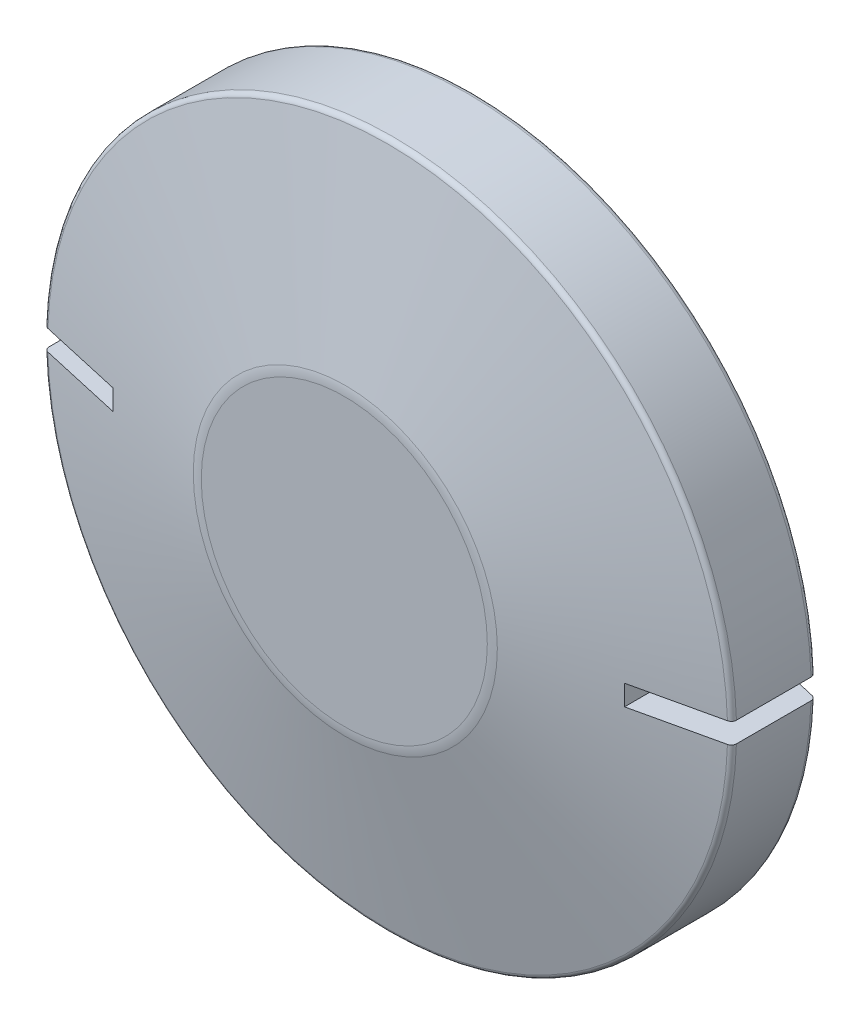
ISO-10303-21;
HEADER;
FILE_DESCRIPTION(('STEP AP214'),'2;1');
FILE_NAME('part.step','',(''),(''),'','','');
FILE_SCHEMA(('AUTOMOTIVE_DESIGN { 1 0 10303 214 1 1 1 1 }'));
ENDSEC;
DATA;
#1=APPLICATION_CONTEXT('core data for automotive mechanical design processes');
#2=APPLICATION_PROTOCOL_DEFINITION('international standard','automotive_design',2000,#1);
#3=PRODUCT_CONTEXT('',#1,'mechanical');
#4=PRODUCT('Part','Part','',(#3));
#5=PRODUCT_RELATED_PRODUCT_CATEGORY('part','',(#4));
#6=PRODUCT_DEFINITION_FORMATION('','',#4);
#7=PRODUCT_DEFINITION_CONTEXT('part definition',#1,'design');
#8=PRODUCT_DEFINITION('design','',#6,#7);
#9=PRODUCT_DEFINITION_SHAPE('','',#8);
#10=(LENGTH_UNIT() NAMED_UNIT(*) SI_UNIT(.MILLI.,.METRE.));
#11=(NAMED_UNIT(*) PLANE_ANGLE_UNIT() SI_UNIT($,.RADIAN.));
#12=(NAMED_UNIT(*) SI_UNIT($,.STERADIAN.) SOLID_ANGLE_UNIT());
#13=UNCERTAINTY_MEASURE_WITH_UNIT(LENGTH_MEASURE(1.E-05),#10,'distance_accuracy_value','');
#14=(GEOMETRIC_REPRESENTATION_CONTEXT(3) GLOBAL_UNCERTAINTY_ASSIGNED_CONTEXT((#13)) GLOBAL_UNIT_ASSIGNED_CONTEXT((#10,
#11,#12)) REPRESENTATION_CONTEXT('',''));
#15=CARTESIAN_POINT('',(0.,0.,0.));
#16=DIRECTION('',(0.,0.,1.));
#17=DIRECTION('',(1.,0.,0.));
#18=AXIS2_PLACEMENT_3D('',#15,#16,#17);
#19=CARTESIAN_POINT('',(-13.9901133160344,-13.9901133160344,16.8));
#20=DIRECTION('',(0.,0.,1.));
#21=DIRECTION('',(1.,0.,0.));
#22=AXIS2_PLACEMENT_3D('',#19,#20,#21);
#23=PLANE('',#22);
#24=CARTESIAN_POINT('',(0.,0.,16.8));
#25=DIRECTION('',(0.,0.,-1.));
#26=DIRECTION('',(-1.,0.,0.));
#27=AXIS2_PLACEMENT_3D('',#24,#25,#26);
#28=CIRCLE('',#27,13.9801133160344);
#29=CARTESIAN_POINT('',(-13.9801133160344,0.,16.8));
#30=VERTEX_POINT('',#29);
#31=EDGE_CURVE('E21',#30,#30,#28,.T.);
#32=ORIENTED_EDGE('',*,*,#31,.F.);
#33=EDGE_LOOP('',(#32));
#34=FACE_BOUND('',#33,.T.);
#35=ADVANCED_FACE('F16',(#34),#23,.T.);
#36=CARTESIAN_POINT('',(14.5457854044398,-14.5457854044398,0.));
#37=DIRECTION('',(0.,0.,-1.));
#38=DIRECTION('',(-1.,0.,0.));
#39=AXIS2_PLACEMENT_3D('',#36,#37,#38);
#40=PLANE('',#39);
#41=CARTESIAN_POINT('',(0.,0.,0.));
#42=DIRECTION('',(0.,0.,-1.));
#43=DIRECTION('',(-1.,0.,0.));
#44=AXIS2_PLACEMENT_3D('',#41,#42,#43);
#45=CIRCLE('',#44,14.5357854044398);
#46=CARTESIAN_POINT('',(-14.5357854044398,0.,0.));
#47=VERTEX_POINT('',#46);
#48=EDGE_CURVE('E243',#47,#47,#45,.F.);
#49=ORIENTED_EDGE('',*,*,#48,.F.);
#50=EDGE_LOOP('',(#49));
#51=FACE_BOUND('',#50,.T.);
#52=ADVANCED_FACE('F485',(#51),#40,.T.);
#53=CARTESIAN_POINT('',(-5.21128131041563E-13,5.74843991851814E-13,4.77559832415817));
#54=DIRECTION('',(0.,0.,1.));
#55=DIRECTION('',(1.,0.,0.));
#56=AXIS2_PLACEMENT_3D('',#53,#54,#55);
#57=CYLINDRICAL_SURFACE('',#56,33.6146574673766);
#58=DIRECTION('',(0.,0.,1.));
#59=VECTOR('',#58,1.);
#60=CARTESIAN_POINT('',(33.5997797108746,1.00000001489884,8.38355223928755));
#61=LINE('',#60,#59);
#62=CARTESIAN_POINT('',(33.5997797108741,1.00000001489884,4.77559832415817));
#63=VERTEX_POINT('',#62);
#64=CARTESIAN_POINT('',(33.5997797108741,1.00000001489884,12.070682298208));
#65=VERTEX_POINT('',#64);
#66=EDGE_CURVE('E255',#63,#65,#61,.T.);
#67=ORIENTED_EDGE('',*,*,#66,.F.);
#68=CARTESIAN_POINT('',(-5.21128131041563E-13,5.74843991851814E-13,4.77559832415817));
#69=DIRECTION('',(0.,0.,-1.));
#70=DIRECTION('',(-1.,0.,0.));
#71=AXIS2_PLACEMENT_3D('',#68,#69,#70);
#72=CIRCLE('',#71,33.6146574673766);
#73=CARTESIAN_POINT('',(-33.5997797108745,1.00000001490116,4.77559832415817));
#74=VERTEX_POINT('',#73);
#75=EDGE_CURVE('E231',#74,#63,#72,.T.);
#76=ORIENTED_EDGE('',*,*,#75,.F.);
#77=DIRECTION('',(0.,0.,-1.));
#78=VECTOR('',#77,1.);
#79=CARTESIAN_POINT('',(-33.5997797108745,1.00000001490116,8.38355223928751));
#80=LINE('',#79,#78);
#81=CARTESIAN_POINT('',(-33.5997797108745,1.00000001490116,12.070682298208));
#82=VERTEX_POINT('',#81);
#83=EDGE_CURVE('E232',#82,#74,#80,.T.);
#84=ORIENTED_EDGE('',*,*,#83,.F.);
#85=CARTESIAN_POINT('',(-5.21128131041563E-13,5.74843991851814E-13,12.070682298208));
#86=DIRECTION('',(0.,0.,1.));
#87=DIRECTION('',(0.,-1.,0.));
#88=AXIS2_PLACEMENT_3D('',#85,#86,#87);
#89=CIRCLE('',#88,33.6146574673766);
#90=EDGE_CURVE('E120',#65,#82,#89,.T.);
#91=ORIENTED_EDGE('',*,*,#90,.F.);
#92=EDGE_LOOP('',(#67,#76,#84,#91));
#93=FACE_BOUND('',#92,.T.);
#94=ADVANCED_FACE('F138',(#93),#57,.T.);
#95=CARTESIAN_POINT('',(25.0000003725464,1.01000001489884,2.34276110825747));
#96=DIRECTION('',(1.,0.,0.));
#97=DIRECTION('',(0.,0.,1.));
#98=AXIS2_PLACEMENT_3D('',#95,#96,#97);
#99=PLANE('',#98);
#100=DIRECTION('',(0.,0.,1.));
#101=VECTOR('',#100,1.);
#102=CARTESIAN_POINT('',(25.0000003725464,-1.00000001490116,8.38355223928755));
#103=LINE('',#102,#101);
#104=CARTESIAN_POINT('',(25.0000003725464,-1.00000001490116,2.35746474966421));
#105=VERTEX_POINT('',#104);
#106=CARTESIAN_POINT('',(25.0000003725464,-1.00000001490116,14.4096397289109));
#107=VERTEX_POINT('',#106);
#108=EDGE_CURVE('E115',#105,#107,#103,.T.);
#109=ORIENTED_EDGE('',*,*,#108,.F.);
#110=CARTESIAN_POINT('',(25.0000003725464,-1.00000001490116,2.35746474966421));
#111=CARTESIAN_POINT('',(25.0000003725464,-0.499800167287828,2.35276110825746));
#112=CARTESIAN_POINT('',(25.0000003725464,0.,2.35276110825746));
#113=B_SPLINE_CURVE_WITH_KNOTS('',2,(#110,#111,#112),.UNSPECIFIED.,.F.,.F.,(3,3),(0.,1.),.UNSPECIFIED.);
#114=CARTESIAN_POINT('',(25.0000003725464,0.,2.35276110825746));
#115=VERTEX_POINT('',#114);
#116=EDGE_CURVE('E103',#105,#115,#113,.T.);
#117=ORIENTED_EDGE('',*,*,#116,.T.);
#118=CARTESIAN_POINT('',(25.0000003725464,0.,2.35276110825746));
#119=CARTESIAN_POINT('',(25.0000003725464,0.499800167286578,2.35276110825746));
#120=CARTESIAN_POINT('',(25.0000003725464,1.00000001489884,2.35746474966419));
#121=B_SPLINE_CURVE_WITH_KNOTS('',2,(#118,#119,#120),.UNSPECIFIED.,.F.,.F.,(3,3),(0.,1.),.UNSPECIFIED.);
#122=CARTESIAN_POINT('',(25.0000003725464,1.00000001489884,2.35746474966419));
#123=VERTEX_POINT('',#122);
#124=EDGE_CURVE('E98',#115,#123,#121,.T.);
#125=ORIENTED_EDGE('',*,*,#124,.T.);
#126=DIRECTION('',(0.,0.,-1.));
#127=VECTOR('',#126,1.);
#128=CARTESIAN_POINT('',(25.0000003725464,1.00000001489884,8.38355223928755));
#129=LINE('',#128,#127);
#130=CARTESIAN_POINT('',(25.0000003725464,1.00000001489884,14.4096397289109));
#131=VERTEX_POINT('',#130);
#132=EDGE_CURVE('E254',#131,#123,#129,.T.);
#133=ORIENTED_EDGE('',*,*,#132,.F.);
#134=CARTESIAN_POINT('',(25.0000003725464,1.00000001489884,14.4096397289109));
#135=CARTESIAN_POINT('',(25.0000003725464,0.499800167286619,14.4141504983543));
#136=CARTESIAN_POINT('',(25.0000003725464,0.,14.4141504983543));
#137=B_SPLINE_CURVE_WITH_KNOTS('',2,(#134,#135,#136),.UNSPECIFIED.,.F.,.F.,(3,3),(0.,1.),.UNSPECIFIED.);
#138=CARTESIAN_POINT('',(25.0000003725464,0.,14.4141504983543));
#139=VERTEX_POINT('',#138);
#140=EDGE_CURVE('E111',#131,#139,#137,.T.);
#141=ORIENTED_EDGE('',*,*,#140,.T.);
#142=CARTESIAN_POINT('',(25.0000003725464,0.,14.4141504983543));
#143=CARTESIAN_POINT('',(25.0000003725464,-0.499800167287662,14.4141504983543));
#144=CARTESIAN_POINT('',(25.0000003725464,-1.00000001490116,14.4096397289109));
#145=B_SPLINE_CURVE_WITH_KNOTS('',2,(#142,#143,#144),.UNSPECIFIED.,.F.,.F.,(3,3),(0.,1.),.UNSPECIFIED.);
#146=EDGE_CURVE('E117',#139,#107,#145,.T.);
#147=ORIENTED_EDGE('',*,*,#146,.T.);
#148=EDGE_LOOP('',(#109,#117,#125,#133,#141,#147));
#149=FACE_BOUND('',#148,.T.);
#150=ADVANCED_FACE('F113',(#149),#99,.T.);
#151=CARTESIAN_POINT('',(0.,0.,12.8000000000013));
#152=DIRECTION('',(0.,0.,-1.));
#153=DIRECTION('',(-1.,0.,0.));
#154=AXIS2_PLACEMENT_3D('',#151,#152,#153);
#155=TOROIDAL_SURFACE('',#154,13.9801133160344,3.99999999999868);
#156=ORIENTED_EDGE('',*,*,#31,.T.);
#157=EDGE_LOOP('',(#156));
#158=FACE_BOUND('',#157,.T.);
#159=CARTESIAN_POINT('',(0.,0.,16.7019130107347));
#160=DIRECTION('',(0.,0.,-1.));
#161=DIRECTION('',(-1.,0.,0.));
#162=AXIS2_PLACEMENT_3D('',#159,#160,#161);
#163=CIRCLE('',#162,14.8604966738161);
#164=CARTESIAN_POINT('',(-14.8604966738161,0.,16.7019130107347));
#165=VERTEX_POINT('',#164);
#166=EDGE_CURVE('E278',#165,#165,#163,.T.);
#167=ORIENTED_EDGE('',*,*,#166,.F.);
#168=EDGE_LOOP('',(#167));
#169=FACE_BOUND('',#168,.T.);
#170=ADVANCED_FACE('F137',(#158,#169),#155,.T.);
#171=CARTESIAN_POINT('',(-5.20417042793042E-13,5.74843991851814E-13,12.070682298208));
#172=DIRECTION('',(0.,0.,-1.));
#173=DIRECTION('',(0.,1.,0.));
#174=AXIS2_PLACEMENT_3D('',#171,#172,#173);
#175=TOROIDAL_SURFACE('',#174,33.1146574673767,0.49999999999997);
#176=CARTESIAN_POINT('',(33.5997797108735,1.00000001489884,12.070682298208));
#177=CARTESIAN_POINT('',(33.5998036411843,1.00000001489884,12.0987974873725));
#178=CARTESIAN_POINT('',(33.5974087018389,1.00000001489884,12.1269055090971));
#179=CARTESIAN_POINT('',(33.5879560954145,1.00000001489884,12.182314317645));
#180=CARTESIAN_POINT('',(33.5809005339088,1.00000001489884,12.209615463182));
#181=CARTESIAN_POINT('',(33.5622975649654,1.00000001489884,12.262655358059));
#182=CARTESIAN_POINT('',(33.5507483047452,1.00000001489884,12.2883934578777));
#183=CARTESIAN_POINT('',(33.5234996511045,1.00000001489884,12.3375562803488));
#184=CARTESIAN_POINT('',(33.5078018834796,1.00000001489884,12.3609819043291));
#185=CARTESIAN_POINT('',(33.4726945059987,1.00000001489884,12.4048708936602));
#186=CARTESIAN_POINT('',(33.4532841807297,1.00000001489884,12.4253336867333));
#187=CARTESIAN_POINT('',(33.4112977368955,1.00000001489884,12.4627215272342));
#188=CARTESIAN_POINT('',(33.3887203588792,1.00000001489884,12.4796451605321));
#189=CARTESIAN_POINT('',(33.3410546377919,1.00000001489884,12.509451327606));
#190=CARTESIAN_POINT('',(33.315967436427,1.00000001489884,12.5223356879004));
#191=CARTESIAN_POINT('',(33.2639844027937,1.00000001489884,12.5437401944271));
#192=CARTESIAN_POINT('',(33.23708781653,1.00000001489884,12.5522585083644));
#193=CARTESIAN_POINT('',(33.2096529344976,1.00000001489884,12.5584214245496));
#194=B_SPLINE_CURVE_WITH_KNOTS('',3,(#176,#177,#178,#179,#180,#181,#182,#183,#184,#185,#186,
#187,#188,#189,#190,#191,#192,#193),.UNSPECIFIED.,.F.,.F.,(4,2,2,2,2,2,2,2,4),(0.,
0.0842334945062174,0.168428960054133,0.252659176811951,0.336856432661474,0.421069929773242,
0.505317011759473,0.589525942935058,0.673770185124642),.UNSPECIFIED.);
#195=CARTESIAN_POINT('',(33.2096529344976,1.00000001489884,12.5584214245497));
#196=VERTEX_POINT('',#195);
#197=EDGE_CURVE('E249',#65,#196,#194,.T.);
#198=ORIENTED_EDGE('',*,*,#197,.F.);
#199=ORIENTED_EDGE('',*,*,#90,.T.);
#200=CARTESIAN_POINT('',(-33.2096529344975,1.00000001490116,12.5584214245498));
#201=CARTESIAN_POINT('',(-33.2371092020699,1.00000001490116,12.5522537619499));
#202=CARTESIAN_POINT('',(-33.264026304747,1.00000001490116,12.5437269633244));
#203=CARTESIAN_POINT('',(-33.3160469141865,1.00000001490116,12.5222989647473));
#204=CARTESIAN_POINT('',(-33.3411511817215,1.00000001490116,12.5093996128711));
#205=CARTESIAN_POINT('',(-33.3888453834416,1.00000001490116,12.4795582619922));
#206=CARTESIAN_POINT('',(-33.4114342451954,1.00000001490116,12.4626145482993));
#207=CARTESIAN_POINT('',(-33.4534375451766,1.00000001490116,12.4251824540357));
#208=CARTESIAN_POINT('',(-33.4728532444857,1.00000001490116,12.4046954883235));
#209=CARTESIAN_POINT('',(-33.5079626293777,1.00000001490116,12.360757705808));
#210=CARTESIAN_POINT('',(-33.5236573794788,1.00000001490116,12.3373077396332));
#211=CARTESIAN_POINT('',(-33.550893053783,1.00000001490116,12.2880958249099));
#212=CARTESIAN_POINT('',(-33.562432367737,1.00000001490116,12.2623329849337));
#213=CARTESIAN_POINT('',(-33.5809823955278,1.00000001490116,12.2093196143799));
#214=CARTESIAN_POINT('',(-33.5880075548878,1.00000001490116,12.1820741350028));
#215=CARTESIAN_POINT('',(-33.5974190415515,1.00000001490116,12.1267825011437));
#216=CARTESIAN_POINT('',(-33.5998033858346,1.00000001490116,12.0987360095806));
#217=CARTESIAN_POINT('',(-33.5997797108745,1.00000001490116,12.070682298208));
#218=B_SPLINE_CURVE_WITH_KNOTS('',3,(#200,#201,#202,#203,#204,#205,#206,#207,#208,#209,#210,
#211,#212,#213,#214,#215,#216,#217),.UNSPECIFIED.,.F.,.F.,(4,2,2,2,2,2,2,2,4),(0.,
0.0843096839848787,0.168583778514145,0.252893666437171,0.337169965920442,0.421422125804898,
0.5057068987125,0.589720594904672,0.673770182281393),.UNSPECIFIED.);
#219=CARTESIAN_POINT('',(-33.2096529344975,1.00000001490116,12.5584214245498));
#220=VERTEX_POINT('',#219);
#221=EDGE_CURVE('E238',#220,#82,#218,.T.);
#222=ORIENTED_EDGE('',*,*,#221,.F.);
#223=CARTESIAN_POINT('',(0.,0.,12.5584214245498));
#224=DIRECTION('',(0.,0.,1.));
#225=DIRECTION('',(1.,0.,0.));
#226=AXIS2_PLACEMENT_3D('',#223,#224,#225);
#227=CIRCLE('',#226,33.2247053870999);
#228=EDGE_CURVE('E277',#196,#220,#227,.T.);
#229=ORIENTED_EDGE('',*,*,#228,.F.);
#230=EDGE_LOOP('',(#198,#199,#222,#229));
#231=FACE_BOUND('',#230,.T.);
#232=ADVANCED_FACE('F244',(#231),#175,.T.);
#233=CARTESIAN_POINT('',(0.,0.,3.99999999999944));
#234=DIRECTION('',(0.,0.,-1.));
#235=DIRECTION('',(-1.,0.,0.));
#236=AXIS2_PLACEMENT_3D('',#233,#234,#235);
#237=TOROIDAL_SURFACE('',#236,14.5357854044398,3.99999999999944);
#238=CARTESIAN_POINT('',(0.,0.,0.106315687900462));
#239=DIRECTION('',(0.,0.,1.));
#240=DIRECTION('',(1.,0.,0.));
#241=AXIS2_PLACEMENT_3D('',#238,#239,#240);
#242=CIRCLE('',#241,15.4518762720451);
#243=CARTESIAN_POINT('',(15.4518762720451,0.,0.106315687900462));
#244=VERTEX_POINT('',#243);
#245=EDGE_CURVE('E305',#244,#244,#242,.T.);
#246=ORIENTED_EDGE('',*,*,#245,.F.);
#247=EDGE_LOOP('',(#246));
#248=FACE_BOUND('',#247,.T.);
#249=ORIENTED_EDGE('',*,*,#48,.T.);
#250=EDGE_LOOP('',(#249));
#251=FACE_BOUND('',#250,.T.);
#252=ADVANCED_FACE('F211',(#248,#251),#237,.T.);
#253=CARTESIAN_POINT('',(-33.6097797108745,1.00000001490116,14.4196397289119));
#254=DIRECTION('',(0.,-1.,0.));
#255=DIRECTION('',(0.,0.,-1.));
#256=AXIS2_PLACEMENT_3D('',#253,#254,#255);
#257=PLANE('',#256);
#258=CARTESIAN_POINT('',(-25.0000003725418,1.00000001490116,2.35746474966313));
#259=CARTESIAN_POINT('',(-26.3690322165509,1.00000001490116,2.67931681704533));
#260=CARTESIAN_POINT('',(-27.7380579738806,1.00000001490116,3.0011947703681));
#261=CARTESIAN_POINT('',(-30.4760973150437,1.00000001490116,3.64500244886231));
#262=CARTESIAN_POINT('',(-31.845110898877,1.00000001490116,3.96693217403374));
#263=CARTESIAN_POINT('',(-33.214118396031,1.00000001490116,4.28888778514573));
#264=B_SPLINE_CURVE_WITH_KNOTS('',3,(#258,#259,#260,#261,#262,#263),.UNSPECIFIED.,.F.,.F.,(4,2,
4),(0.,4.21906772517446,8.43813544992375),.UNSPECIFIED.);
#265=CARTESIAN_POINT('',(-25.0000003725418,1.00000001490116,2.35746474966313));
#266=VERTEX_POINT('',#265);
#267=CARTESIAN_POINT('',(-33.214118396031,1.00000001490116,4.28888778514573));
#268=VERTEX_POINT('',#267);
#269=EDGE_CURVE('E194',#266,#268,#264,.T.);
#270=ORIENTED_EDGE('',*,*,#269,.F.);
#271=DIRECTION('',(0.,0.,-1.));
#272=VECTOR('',#271,1.);
#273=CARTESIAN_POINT('',(-25.0000003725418,1.00000001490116,8.38335944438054));
#274=LINE('',#273,#272);
#275=CARTESIAN_POINT('',(-25.0000003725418,1.00000001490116,14.4096397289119));
#276=VERTEX_POINT('',#275);
#277=EDGE_CURVE('E300',#276,#266,#274,.T.);
#278=ORIENTED_EDGE('',*,*,#277,.F.);
#279=CARTESIAN_POINT('',(-33.2096529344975,1.00000001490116,12.5584214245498));
#280=CARTESIAN_POINT('',(-31.8413887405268,1.00000001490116,12.867007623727));
#281=CARTESIAN_POINT('',(-30.4731189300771,1.00000001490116,13.1755689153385));
#282=CARTESIAN_POINT('',(-27.7365680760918,1.00000001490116,13.7926416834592));
#283=CARTESIAN_POINT('',(-26.3682870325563,1.00000001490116,14.1011531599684));
#284=CARTESIAN_POINT('',(-25.0000003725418,1.00000001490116,14.4096397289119));
#285=B_SPLINE_CURVE_WITH_KNOTS('',3,(#279,#280,#281,#282,#283,#284),.UNSPECIFIED.,.F.,.F.,(4,2,
4),(0.,4.2078915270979,8.41578305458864),.UNSPECIFIED.);
#286=EDGE_CURVE('E217',#220,#276,#285,.T.);
#287=ORIENTED_EDGE('',*,*,#286,.F.);
#288=ORIENTED_EDGE('',*,*,#221,.T.);
#289=ORIENTED_EDGE('',*,*,#83,.T.);
#290=CARTESIAN_POINT('',(-33.214118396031,1.00000001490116,4.28888778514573));
#291=CARTESIAN_POINT('',(-33.2415169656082,1.00000001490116,4.29530658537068));
#292=CARTESIAN_POINT('',(-33.268354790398,1.00000001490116,4.30407949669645));
#293=CARTESIAN_POINT('',(-33.3201764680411,1.00000001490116,4.32598278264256));
#294=CARTESIAN_POINT('',(-33.345161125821,1.00000001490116,4.33911125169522));
#295=CARTESIAN_POINT('',(-33.3925792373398,1.00000001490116,4.36938752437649));
#296=CARTESIAN_POINT('',(-33.4150116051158,1.00000001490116,4.38653702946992));
#297=CARTESIAN_POINT('',(-33.4566700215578,1.00000001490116,4.42435178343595));
#298=CARTESIAN_POINT('',(-33.4758972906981,1.00000001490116,4.44501568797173));
#299=CARTESIAN_POINT('',(-33.5106030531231,1.00000001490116,4.48927327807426));
#300=CARTESIAN_POINT('',(-33.5260825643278,1.00000001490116,4.51286616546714));
#301=CARTESIAN_POINT('',(-33.5528659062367,1.00000001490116,4.5623253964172));
#302=CARTESIAN_POINT('',(-33.5641683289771,1.00000001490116,4.58819250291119));
#303=CARTESIAN_POINT('',(-33.5819881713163,1.00000001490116,4.64065342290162));
#304=CARTESIAN_POINT('',(-33.5886394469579,1.00000001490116,4.66720188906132));
#305=CARTESIAN_POINT('',(-33.5975460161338,1.00000001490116,4.72103042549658));
#306=CARTESIAN_POINT('',(-33.5998004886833,1.00000001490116,4.74831063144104));
#307=CARTESIAN_POINT('',(-33.5997797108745,1.00000001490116,4.77559832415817));
#308=B_SPLINE_CURVE_WITH_KNOTS('',3,(#290,#291,#292,#293,#294,#295,#296,#297,#298,#299,#300,
#301,#302,#303,#304,#305,#306,#307),.UNSPECIFIED.,.F.,.F.,(4,2,2,2,2,2,2,2,4),(0.,
0.0843094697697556,0.168582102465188,0.252890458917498,0.337166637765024,0.421419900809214,
0.505701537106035,0.587444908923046,0.669203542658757),.UNSPECIFIED.);
#309=EDGE_CURVE('E225',#268,#74,#308,.T.);
#310=ORIENTED_EDGE('',*,*,#309,.F.);
#311=EDGE_LOOP('',(#270,#278,#287,#288,#289,#310));
#312=FACE_BOUND('',#311,.T.);
#313=ADVANCED_FACE('F205',(#312),#257,.T.);
#314=CARTESIAN_POINT('',(-6.10622663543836E-13,5.28656979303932E-13,4.77559832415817));
#315=DIRECTION('',(0.,0.,-1.));
#316=DIRECTION('',(-1.,0.,0.));
#317=AXIS2_PLACEMENT_3D('',#314,#315,#316);
#318=TOROIDAL_SURFACE('',#317,33.1146574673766,0.499999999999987);
#319=CARTESIAN_POINT('',(33.214118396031,1.00000001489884,4.288887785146));
#320=CARTESIAN_POINT('',(33.2415169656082,1.00000001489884,4.29530658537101));
#321=CARTESIAN_POINT('',(33.268354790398,1.00000001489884,4.30407949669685));
#322=CARTESIAN_POINT('',(33.320176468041,1.00000001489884,4.32598278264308));
#323=CARTESIAN_POINT('',(33.3451611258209,1.00000001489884,4.3391112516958));
#324=CARTESIAN_POINT('',(33.3925792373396,1.00000001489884,4.36938752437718));
#325=CARTESIAN_POINT('',(33.4150116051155,1.00000001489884,4.38653702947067));
#326=CARTESIAN_POINT('',(33.4566700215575,1.00000001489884,4.4243517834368));
#327=CARTESIAN_POINT('',(33.4758972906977,1.00000001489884,4.44501568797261));
#328=CARTESIAN_POINT('',(33.5106030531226,1.00000001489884,4.48927327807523));
#329=CARTESIAN_POINT('',(33.5260825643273,1.00000001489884,4.51286616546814));
#330=CARTESIAN_POINT('',(33.5528659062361,1.00000001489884,4.56232539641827));
#331=CARTESIAN_POINT('',(33.5641683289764,1.00000001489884,4.58819250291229));
#332=CARTESIAN_POINT('',(33.5819881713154,1.00000001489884,4.64065342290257));
#333=CARTESIAN_POINT('',(33.5886394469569,1.00000001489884,4.66720188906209));
#334=CARTESIAN_POINT('',(33.5975460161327,1.00000001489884,4.72103042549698));
#335=CARTESIAN_POINT('',(33.5998004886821,1.00000001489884,4.74831063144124));
#336=CARTESIAN_POINT('',(33.5997797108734,1.00000001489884,4.77559832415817));
#337=B_SPLINE_CURVE_WITH_KNOTS('',3,(#319,#320,#321,#322,#323,#324,#325,#326,#327,#328,#329,
#330,#331,#332,#333,#334,#335,#336),.UNSPECIFIED.,.F.,.F.,(4,2,2,2,2,2,2,2,4),(0.,
0.0843094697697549,0.168582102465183,0.252890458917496,0.337166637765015,0.421419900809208,
0.505701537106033,0.587444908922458,0.669203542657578),.UNSPECIFIED.);
#338=CARTESIAN_POINT('',(33.214118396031,1.00000001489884,4.28888778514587));
#339=VERTEX_POINT('',#338);
#340=EDGE_CURVE('E233',#339,#63,#337,.T.);
#341=ORIENTED_EDGE('',*,*,#340,.F.);
#342=CARTESIAN_POINT('',(0.,0.,4.28888778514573));
#343=DIRECTION('',(0.,0.,-1.));
#344=DIRECTION('',(-1.,0.,0.));
#345=AXIS2_PLACEMENT_3D('',#342,#343,#344);
#346=CIRCLE('',#345,33.2291688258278);
#347=EDGE_CURVE('E200',#268,#339,#346,.T.);
#348=ORIENTED_EDGE('',*,*,#347,.F.);
#349=ORIENTED_EDGE('',*,*,#309,.T.);
#350=ORIENTED_EDGE('',*,*,#75,.T.);
#351=EDGE_LOOP('',(#341,#348,#349,#350));
#352=FACE_BOUND('',#351,.T.);
#353=ADVANCED_FACE('F210',(#352),#318,.T.);
#354=CARTESIAN_POINT('',(33.6097797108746,1.00000001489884,2.34746474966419));
#355=DIRECTION('',(0.,-1.,0.));
#356=DIRECTION('',(0.,0.,1.));
#357=AXIS2_PLACEMENT_3D('',#354,#355,#356);
#358=PLANE('',#357);
#359=CARTESIAN_POINT('',(25.0000003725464,1.00000001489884,14.4096397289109));
#360=CARTESIAN_POINT('',(26.3682870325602,1.00000001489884,14.1011531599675));
#361=CARTESIAN_POINT('',(27.7365680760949,1.00000001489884,13.7926416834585));
#362=CARTESIAN_POINT('',(30.4731189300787,1.00000001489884,13.1755689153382));
#363=CARTESIAN_POINT('',(31.8413887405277,1.00000001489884,12.8670076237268));
#364=CARTESIAN_POINT('',(33.2096529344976,1.00000001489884,12.5584214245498));
#365=B_SPLINE_CURVE_WITH_KNOTS('',3,(#359,#360,#361,#362,#363,#364),.UNSPECIFIED.,.F.,.F.,(4,2,
4),(0.,4.20789152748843,8.41578305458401),.UNSPECIFIED.);
#366=EDGE_CURVE('E271',#131,#196,#365,.T.);
#367=ORIENTED_EDGE('',*,*,#366,.F.);
#368=ORIENTED_EDGE('',*,*,#132,.T.);
#369=CARTESIAN_POINT('',(33.2141183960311,1.00000001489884,4.28888778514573));
#370=CARTESIAN_POINT('',(31.8451108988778,1.00000001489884,3.96693217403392));
#371=CARTESIAN_POINT('',(30.4760973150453,1.00000001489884,3.64500244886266));
#372=CARTESIAN_POINT('',(27.7380579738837,1.00000001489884,3.0011947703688));
#373=CARTESIAN_POINT('',(26.3690322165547,1.00000001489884,2.67931681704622));
#374=CARTESIAN_POINT('',(25.0000003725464,1.00000001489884,2.35746474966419));
#375=B_SPLINE_CURVE_WITH_KNOTS('',3,(#369,#370,#371,#372,#373,#374),.UNSPECIFIED.,.F.,.F.,(4,2,
4),(0.,4.21906772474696,8.43813544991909),.UNSPECIFIED.);
#376=EDGE_CURVE('E107',#339,#123,#375,.T.);
#377=ORIENTED_EDGE('',*,*,#376,.F.);
#378=ORIENTED_EDGE('',*,*,#340,.T.);
#379=ORIENTED_EDGE('',*,*,#66,.T.);
#380=ORIENTED_EDGE('',*,*,#197,.T.);
#381=EDGE_LOOP('',(#367,#368,#377,#378,#379,#380));
#382=FACE_BOUND('',#381,.T.);
#383=ADVANCED_FACE('F262',(#382),#358,.T.);
#384=CARTESIAN_POINT('',(6.10622663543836E-13,-5.28656979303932E-13,4.77559832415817));
#385=DIRECTION('',(0.,0.,-1.));
#386=DIRECTION('',(-1.,0.,0.));
#387=AXIS2_PLACEMENT_3D('',#384,#385,#386);
#388=TOROIDAL_SURFACE('',#387,33.1146574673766,0.499999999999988);
#389=CARTESIAN_POINT('',(33.5997797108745,-1.00000001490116,4.77559832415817));
#390=CARTESIAN_POINT('',(33.5998036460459,-1.00000001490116,4.7474829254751));
#391=CARTESIAN_POINT('',(33.597408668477,-1.00000001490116,4.7193746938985));
#392=CARTESIAN_POINT('',(33.5879559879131,-1.00000001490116,4.66396589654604));
#393=CARTESIAN_POINT('',(33.5809004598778,-1.00000001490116,4.63666496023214));
#394=CARTESIAN_POINT('',(33.5622976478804,-1.00000001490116,4.58362548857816));
#395=CARTESIAN_POINT('',(33.5507485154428,-1.00000001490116,4.55788760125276));
#396=CARTESIAN_POINT('',(33.5234998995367,-1.00000001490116,4.50872473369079));
#397=CARTESIAN_POINT('',(33.5078019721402,-1.00000001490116,4.48529889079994));
#398=CARTESIAN_POINT('',(33.4726941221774,-1.00000001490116,4.44140918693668));
#399=CARTESIAN_POINT('',(33.453283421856,-1.00000001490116,4.42094594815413));
#400=CARTESIAN_POINT('',(33.4112963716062,-1.00000001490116,4.38355819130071));
#401=CARTESIAN_POINT('',(33.3887189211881,-1.00000001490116,4.36663490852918));
#402=CARTESIAN_POINT('',(33.3416986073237,-1.00000001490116,4.33723164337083));
#403=CARTESIAN_POINT('',(33.3173238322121,-1.00000001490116,4.3246425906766));
#404=CARTESIAN_POINT('',(33.2668489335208,-1.00000001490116,4.30359086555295));
#405=CARTESIAN_POINT('',(33.2407485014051,-1.00000001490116,4.29512893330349));
#406=CARTESIAN_POINT('',(33.214118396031,-1.00000001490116,4.28888778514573));
#407=B_SPLINE_CURVE_WITH_KNOTS('',3,(#389,#390,#391,#392,#393,#394,#395,#396,#397,#398,#399,
#400,#401,#402,#403,#404,#405,#406),.UNSPECIFIED.,.F.,.F.,(4,2,2,2,2,2,2,2,4),(0.,
0.0842341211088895,0.168428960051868,0.252658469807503,0.336856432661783,0.421072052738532,
0.505317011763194,0.587252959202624,0.669203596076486),.UNSPECIFIED.);
#408=CARTESIAN_POINT('',(33.5997797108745,-1.00000001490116,4.77559832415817));
#409=VERTEX_POINT('',#408);
#410=CARTESIAN_POINT('',(33.214118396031,-1.00000001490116,4.28888778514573));
#411=VERTEX_POINT('',#410);
#412=EDGE_CURVE('E333',#409,#411,#407,.T.);
#413=ORIENTED_EDGE('',*,*,#412,.F.);
#414=CARTESIAN_POINT('',(5.21128131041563E-13,-5.74843991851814E-13,4.77559832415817));
#415=DIRECTION('',(0.,0.,1.));
#416=DIRECTION('',(1.,0.,0.));
#417=AXIS2_PLACEMENT_3D('',#414,#415,#416);
#418=CIRCLE('',#417,33.6146574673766);
#419=CARTESIAN_POINT('',(-33.599779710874,-1.00000001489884,4.77559832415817));
#420=VERTEX_POINT('',#419);
#421=EDGE_CURVE('E328',#420,#409,#418,.T.);
#422=ORIENTED_EDGE('',*,*,#421,.F.);
#423=CARTESIAN_POINT('',(-33.5997797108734,-1.00000001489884,4.77559832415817));
#424=CARTESIAN_POINT('',(-33.5998036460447,-1.00000001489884,4.7474829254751));
#425=CARTESIAN_POINT('',(-33.5974086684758,-1.00000001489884,4.7193746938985));
#426=CARTESIAN_POINT('',(-33.5879559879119,-1.00000001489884,4.66396589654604));
#427=CARTESIAN_POINT('',(-33.5809004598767,-1.00000001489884,4.63666496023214));
#428=CARTESIAN_POINT('',(-33.5622976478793,-1.00000001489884,4.58362548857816));
#429=CARTESIAN_POINT('',(-33.5507485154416,-1.00000001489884,4.55788760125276));
#430=CARTESIAN_POINT('',(-33.5234998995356,-1.00000001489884,4.5087247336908));
#431=CARTESIAN_POINT('',(-33.5078019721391,-1.00000001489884,4.48529889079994));
#432=CARTESIAN_POINT('',(-33.4726941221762,-1.00000001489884,4.44140918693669));
#433=CARTESIAN_POINT('',(-33.4532834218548,-1.00000001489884,4.42094594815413));
#434=CARTESIAN_POINT('',(-33.4112963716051,-1.00000001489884,4.38355819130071));
#435=CARTESIAN_POINT('',(-33.388718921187,-1.00000001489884,4.36663490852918));
#436=CARTESIAN_POINT('',(-33.3416986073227,-1.00000001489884,4.33723164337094));
#437=CARTESIAN_POINT('',(-33.3173238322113,-1.00000001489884,4.32464259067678));
#438=CARTESIAN_POINT('',(-33.2668489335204,-1.00000001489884,4.30359086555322));
#439=CARTESIAN_POINT('',(-33.2407485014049,-1.00000001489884,4.29512893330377));
#440=CARTESIAN_POINT('',(-33.214118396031,-1.00000001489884,4.288887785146));
#441=B_SPLINE_CURVE_WITH_KNOTS('',3,(#423,#424,#425,#426,#427,#428,#429,#430,#431,#432,#433,
#434,#435,#436,#437,#438,#439,#440),.UNSPECIFIED.,.F.,.F.,(4,2,2,2,2,2,2,2,4),(0.,
0.0842341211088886,0.168428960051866,0.252658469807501,0.336856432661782,0.421072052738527,
0.505317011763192,0.587252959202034,0.669203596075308),.UNSPECIFIED.);
#442=CARTESIAN_POINT('',(-33.214118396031,-1.00000001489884,4.28888778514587));
#443=VERTEX_POINT('',#442);
#444=EDGE_CURVE('E256',#420,#443,#441,.T.);
#445=ORIENTED_EDGE('',*,*,#444,.T.);
#446=CARTESIAN_POINT('',(0.,0.,4.28888778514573));
#447=DIRECTION('',(0.,0.,-1.));
#448=DIRECTION('',(-1.,0.,0.));
#449=AXIS2_PLACEMENT_3D('',#446,#447,#448);
#450=CIRCLE('',#449,33.2291688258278);
#451=EDGE_CURVE('E341',#411,#443,#450,.T.);
#452=ORIENTED_EDGE('',*,*,#451,.F.);
#453=EDGE_LOOP('',(#413,#422,#445,#452));
#454=FACE_BOUND('',#453,.T.);
#455=ADVANCED_FACE('F265',(#454),#388,.T.);
#456=CARTESIAN_POINT('',(33.6097797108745,-1.00000001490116,14.4196397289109));
#457=DIRECTION('',(0.,1.,0.));
#458=DIRECTION('',(0.,0.,-1.));
#459=AXIS2_PLACEMENT_3D('',#456,#457,#458);
#460=PLANE('',#459);
#461=DIRECTION('',(0.,0.,1.));
#462=VECTOR('',#461,1.);
#463=CARTESIAN_POINT('',(33.5997797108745,-1.00000001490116,8.42314031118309));
#464=LINE('',#463,#462);
#465=CARTESIAN_POINT('',(33.5997797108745,-1.00000001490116,12.070682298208));
#466=VERTEX_POINT('',#465);
#467=EDGE_CURVE('E324',#409,#466,#464,.T.);
#468=ORIENTED_EDGE('',*,*,#467,.F.);
#469=ORIENTED_EDGE('',*,*,#412,.T.);
#470=CARTESIAN_POINT('',(25.0000003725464,-1.00000001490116,2.35746474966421));
#471=CARTESIAN_POINT('',(26.3690322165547,-1.00000001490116,2.67931681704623));
#472=CARTESIAN_POINT('',(27.7380579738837,-1.00000001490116,3.00119477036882));
#473=CARTESIAN_POINT('',(30.4760973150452,-1.00000001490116,3.64500244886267));
#474=CARTESIAN_POINT('',(31.8451108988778,-1.00000001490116,3.96693217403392));
#475=CARTESIAN_POINT('',(33.214118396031,-1.00000001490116,4.28888778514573));
#476=B_SPLINE_CURVE_WITH_KNOTS('',3,(#470,#471,#472,#473,#474,#475),.UNSPECIFIED.,.F.,.F.,(4,2,
4),(0.,4.2190677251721,8.43813544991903),.UNSPECIFIED.);
#477=EDGE_CURVE('E180',#105,#411,#476,.T.);
#478=ORIENTED_EDGE('',*,*,#477,.F.);
#479=ORIENTED_EDGE('',*,*,#108,.T.);
#480=CARTESIAN_POINT('',(33.2096529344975,-1.00000001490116,12.5584214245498));
#481=CARTESIAN_POINT('',(31.8413887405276,-1.00000001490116,12.8670076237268));
#482=CARTESIAN_POINT('',(30.4731189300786,-1.00000001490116,13.1755689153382));
#483=CARTESIAN_POINT('',(27.7365680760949,-1.00000001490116,13.7926416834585));
#484=CARTESIAN_POINT('',(26.3682870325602,-1.00000001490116,14.1011531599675));
#485=CARTESIAN_POINT('',(25.0000003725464,-1.00000001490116,14.4096397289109));
#486=B_SPLINE_CURVE_WITH_KNOTS('',3,(#480,#481,#482,#483,#484,#485),.UNSPECIFIED.,.F.,.F.,(4,2,
4),(0.,4.20789152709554,8.41578305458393),.UNSPECIFIED.);
#487=CARTESIAN_POINT('',(33.2096529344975,-1.00000001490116,12.5584214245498));
#488=VERTEX_POINT('',#487);
#489=EDGE_CURVE('E279',#488,#107,#486,.T.);
#490=ORIENTED_EDGE('',*,*,#489,.F.);
#491=CARTESIAN_POINT('',(33.5997797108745,-1.00000001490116,12.070682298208));
#492=CARTESIAN_POINT('',(33.5998036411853,-1.00000001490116,12.0987974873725));
#493=CARTESIAN_POINT('',(33.5974087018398,-1.00000001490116,12.1269055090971));
#494=CARTESIAN_POINT('',(33.5879560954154,-1.00000001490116,12.182314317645));
#495=CARTESIAN_POINT('',(33.5809005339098,-1.00000001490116,12.209615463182));
#496=CARTESIAN_POINT('',(33.5622975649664,-1.00000001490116,12.262655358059));
#497=CARTESIAN_POINT('',(33.5507483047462,-1.00000001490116,12.2883934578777));
#498=CARTESIAN_POINT('',(33.5234996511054,-1.00000001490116,12.3375562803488));
#499=CARTESIAN_POINT('',(33.5078018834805,-1.00000001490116,12.3609819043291));
#500=CARTESIAN_POINT('',(33.4726945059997,-1.00000001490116,12.4048708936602));
#501=CARTESIAN_POINT('',(33.4532841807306,-1.00000001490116,12.4253336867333));
#502=CARTESIAN_POINT('',(33.4112977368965,-1.00000001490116,12.4627215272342));
#503=CARTESIAN_POINT('',(33.3887203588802,-1.00000001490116,12.4796451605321));
#504=CARTESIAN_POINT('',(33.3410546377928,-1.00000001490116,12.5094513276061));
#505=CARTESIAN_POINT('',(33.3159674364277,-1.00000001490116,12.5223356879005));
#506=CARTESIAN_POINT('',(33.263984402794,-1.00000001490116,12.5437401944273));
#507=CARTESIAN_POINT('',(33.2370878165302,-1.00000001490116,12.5522585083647));
#508=CARTESIAN_POINT('',(33.2096529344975,-1.00000001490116,12.5584214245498));
#509=B_SPLINE_CURVE_WITH_KNOTS('',3,(#491,#492,#493,#494,#495,#496,#497,#498,#499,#500,#501,
#502,#503,#504,#505,#506,#507,#508),.UNSPECIFIED.,.F.,.F.,(4,2,2,2,2,2,2,2,4),(0.,
0.0842334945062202,0.168428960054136,0.252659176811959,0.336856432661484,0.421069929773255,
0.505317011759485,0.589525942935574,0.673770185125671),.UNSPECIFIED.);
#510=EDGE_CURVE('E323',#466,#488,#509,.T.);
#511=ORIENTED_EDGE('',*,*,#510,.F.);
#512=EDGE_LOOP('',(#468,#469,#478,#479,#490,#511));
#513=FACE_BOUND('',#512,.T.);
#514=ADVANCED_FACE('F370',(#513),#460,.T.);
#515=CARTESIAN_POINT('',(5.20417042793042E-13,-5.74843991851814E-13,12.070682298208));
#516=DIRECTION('',(0.,0.,-1.));
#517=DIRECTION('',(0.,1.,0.));
#518=AXIS2_PLACEMENT_3D('',#515,#516,#517);
#519=TOROIDAL_SURFACE('',#518,33.1146574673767,0.49999999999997);
#520=ORIENTED_EDGE('',*,*,#510,.T.);
#521=CARTESIAN_POINT('',(0.,0.,12.5584214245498));
#522=DIRECTION('',(0.,0.,1.));
#523=DIRECTION('',(1.,0.,0.));
#524=AXIS2_PLACEMENT_3D('',#521,#522,#523);
#525=CIRCLE('',#524,33.2247053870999);
#526=CARTESIAN_POINT('',(-33.2096529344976,-1.00000001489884,12.5584214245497));
#527=VERTEX_POINT('',#526);
#528=EDGE_CURVE('E320',#527,#488,#525,.T.);
#529=ORIENTED_EDGE('',*,*,#528,.F.);
#530=CARTESIAN_POINT('',(-33.2096529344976,-1.00000001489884,12.5584214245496));
#531=CARTESIAN_POINT('',(-33.2371092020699,-1.00000001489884,12.5522537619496));
#532=CARTESIAN_POINT('',(-33.264026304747,-1.00000001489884,12.5437269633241));
#533=CARTESIAN_POINT('',(-33.3160469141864,-1.00000001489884,12.5222989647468));
#534=CARTESIAN_POINT('',(-33.3411511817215,-1.00000001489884,12.5093996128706));
#535=CARTESIAN_POINT('',(-33.3888453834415,-1.00000001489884,12.4795582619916));
#536=CARTESIAN_POINT('',(-33.4114342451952,-1.00000001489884,12.4626145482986));
#537=CARTESIAN_POINT('',(-33.4534375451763,-1.00000001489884,12.4251824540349));
#538=CARTESIAN_POINT('',(-33.4728532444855,-1.00000001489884,12.4046954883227));
#539=CARTESIAN_POINT('',(-33.5079626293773,-1.00000001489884,12.3607577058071));
#540=CARTESIAN_POINT('',(-33.5236573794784,-1.00000001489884,12.3373077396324));
#541=CARTESIAN_POINT('',(-33.5508930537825,-1.00000001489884,12.2880958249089));
#542=CARTESIAN_POINT('',(-33.5624323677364,-1.00000001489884,12.2623329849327));
#543=CARTESIAN_POINT('',(-33.580982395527,-1.00000001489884,12.2093196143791));
#544=CARTESIAN_POINT('',(-33.5880075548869,-1.00000001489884,12.1820741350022));
#545=CARTESIAN_POINT('',(-33.5974190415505,-1.00000001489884,12.1267825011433));
#546=CARTESIAN_POINT('',(-33.5998033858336,-1.00000001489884,12.0987360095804));
#547=CARTESIAN_POINT('',(-33.5997797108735,-1.00000001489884,12.070682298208));
#548=B_SPLINE_CURVE_WITH_KNOTS('',3,(#530,#531,#532,#533,#534,#535,#536,#537,#538,#539,#540,
#541,#542,#543,#544,#545,#546,#547),.UNSPECIFIED.,.F.,.F.,(4,2,2,2,2,2,2,2,4),(0.,
0.0843096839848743,0.168583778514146,0.252893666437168,0.337169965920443,0.421422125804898,
0.5057068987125,0.58972059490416,0.673770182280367),.UNSPECIFIED.);
#549=CARTESIAN_POINT('',(-33.5997797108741,-1.00000001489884,12.070682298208));
#550=VERTEX_POINT('',#549);
#551=EDGE_CURVE('E36',#527,#550,#548,.T.);
#552=ORIENTED_EDGE('',*,*,#551,.T.);
#553=CARTESIAN_POINT('',(5.21128131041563E-13,-5.74843991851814E-13,12.070682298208));
#554=DIRECTION('',(0.,0.,-1.));
#555=DIRECTION('',(0.,1.,0.));
#556=AXIS2_PLACEMENT_3D('',#553,#554,#555);
#557=CIRCLE('',#556,33.6146574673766);
#558=EDGE_CURVE('E327',#466,#550,#557,.T.);
#559=ORIENTED_EDGE('',*,*,#558,.F.);
#560=EDGE_LOOP('',(#520,#529,#552,#559));
#561=FACE_BOUND('',#560,.T.);
#562=ADVANCED_FACE('F288',(#561),#519,.T.);
#563=CARTESIAN_POINT('',(0.,0.,12.5584214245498));
#564=DIRECTION('',(0.,0.,-1.));
#565=DIRECTION('',(-1.,0.,0.));
#566=AXIS2_PLACEMENT_3D('',#563,#564,#565);
#567=CONICAL_SURFACE('',#566,33.2247053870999,1.3488836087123);
#568=ORIENTED_EDGE('',*,*,#166,.T.);
#569=EDGE_LOOP('',(#568));
#570=FACE_BOUND('',#569,.T.);
#571=ORIENTED_EDGE('',*,*,#286,.T.);
#572=CARTESIAN_POINT('',(-25.0000003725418,-1.00000001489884,14.4096397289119));
#573=CARTESIAN_POINT('',(-25.0000003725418,-0.66666667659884,14.4126469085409));
#574=CARTESIAN_POINT('',(-25.0000003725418,-0.33333333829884,14.4141504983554));
#575=CARTESIAN_POINT('',(-25.0000003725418,0.333333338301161,14.4141504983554));
#576=CARTESIAN_POINT('',(-25.0000003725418,0.666666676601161,14.4126469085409));
#577=CARTESIAN_POINT('',(-25.0000003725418,1.00000001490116,14.4096397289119));
#578=B_SPLINE_CURVE_WITH_KNOTS('',3,(#572,#573,#574,#575,#576,#577),.UNSPECIFIED.,.F.,.F.,(4,2,
4),(0.,1.00001018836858,2.00002037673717),.UNSPECIFIED.);
#579=CARTESIAN_POINT('',(-25.0000003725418,-1.00000001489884,14.4096397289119));
#580=VERTEX_POINT('',#579);
#581=EDGE_CURVE('E293',#580,#276,#578,.T.);
#582=ORIENTED_EDGE('',*,*,#581,.F.);
#583=CARTESIAN_POINT('',(-33.2096529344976,-1.00000001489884,12.5584214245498));
#584=CARTESIAN_POINT('',(-31.8413887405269,-1.00000001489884,12.867007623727));
#585=CARTESIAN_POINT('',(-30.4731189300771,-1.00000001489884,13.1755689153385));
#586=CARTESIAN_POINT('',(-27.7365680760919,-1.00000001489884,13.7926416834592));
#587=CARTESIAN_POINT('',(-26.3682870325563,-1.00000001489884,14.1011531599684));
#588=CARTESIAN_POINT('',(-25.0000003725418,-1.00000001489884,14.4096397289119));
#589=B_SPLINE_CURVE_WITH_KNOTS('',3,(#583,#584,#585,#586,#587,#588),.UNSPECIFIED.,.F.,.F.,(4,2,
4),(0.,4.20789152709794,8.41578305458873),.UNSPECIFIED.);
#590=EDGE_CURVE('E165',#527,#580,#589,.T.);
#591=ORIENTED_EDGE('',*,*,#590,.F.);
#592=ORIENTED_EDGE('',*,*,#528,.T.);
#593=ORIENTED_EDGE('',*,*,#489,.T.);
#594=ORIENTED_EDGE('',*,*,#146,.F.);
#595=ORIENTED_EDGE('',*,*,#140,.F.);
#596=ORIENTED_EDGE('',*,*,#366,.T.);
#597=ORIENTED_EDGE('',*,*,#228,.T.);
#598=EDGE_LOOP('',(#571,#582,#591,#592,#593,#594,#595,#596,#597));
#599=FACE_BOUND('',#598,.T.);
#600=ADVANCED_FACE('F284',(#570,#599),#567,.T.);
#601=CARTESIAN_POINT('',(-25.0000003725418,-1.01000001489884,2.33806122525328));
#602=DIRECTION('',(-1.,0.,0.));
#603=DIRECTION('',(0.,0.,1.));
#604=AXIS2_PLACEMENT_3D('',#601,#602,#603);
#605=PLANE('',#604);
#606=CARTESIAN_POINT('',(-25.0000003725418,-1.00000001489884,2.3574647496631));
#607=CARTESIAN_POINT('',(-25.0000003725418,-0.666666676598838,2.35432898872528));
#608=CARTESIAN_POINT('',(-25.0000003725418,-0.333333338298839,2.35276110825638));
#609=CARTESIAN_POINT('',(-25.0000003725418,0.333333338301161,2.35276110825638));
#610=CARTESIAN_POINT('',(-25.0000003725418,0.666666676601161,2.3543289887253));
#611=CARTESIAN_POINT('',(-25.0000003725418,1.00000001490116,2.35746474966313));
#612=B_SPLINE_CURVE_WITH_KNOTS('',3,(#606,#607,#608,#609,#610,#611),.UNSPECIFIED.,.F.,.F.,(4,2,
4),(0.,1.00001107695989,2.00002215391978),.UNSPECIFIED.);
#613=CARTESIAN_POINT('',(-25.0000003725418,-1.00000001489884,2.3574647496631));
#614=VERTEX_POINT('',#613);
#615=EDGE_CURVE('E201',#614,#266,#612,.T.);
#616=ORIENTED_EDGE('',*,*,#615,.F.);
#617=DIRECTION('',(0.,0.,-1.));
#618=VECTOR('',#617,1.);
#619=CARTESIAN_POINT('',(-25.0000003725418,-1.00000001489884,8.3835522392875));
#620=LINE('',#619,#618);
#621=EDGE_CURVE('E164',#580,#614,#620,.T.);
#622=ORIENTED_EDGE('',*,*,#621,.F.);
#623=ORIENTED_EDGE('',*,*,#581,.T.);
#624=ORIENTED_EDGE('',*,*,#277,.T.);
#625=EDGE_LOOP('',(#616,#622,#623,#624));
#626=FACE_BOUND('',#625,.T.);
#627=ADVANCED_FACE('F175',(#626),#605,.T.);
#628=CARTESIAN_POINT('',(0.,0.,0.106315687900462));
#629=DIRECTION('',(0.,0.,1.));
#630=DIRECTION('',(1.,0.,0.));
#631=AXIS2_PLACEMENT_3D('',#628,#629,#630);
#632=CONICAL_SURFACE('',#631,15.4518762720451,1.33972273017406);
#633=ORIENTED_EDGE('',*,*,#124,.F.);
#634=ORIENTED_EDGE('',*,*,#116,.F.);
#635=ORIENTED_EDGE('',*,*,#477,.T.);
#636=ORIENTED_EDGE('',*,*,#451,.T.);
#637=CARTESIAN_POINT('',(-25.0000003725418,-1.00000001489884,2.3574647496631));
#638=CARTESIAN_POINT('',(-26.3690322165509,-1.00000001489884,2.67931681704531));
#639=CARTESIAN_POINT('',(-27.7380579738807,-1.00000001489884,3.00119477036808));
#640=CARTESIAN_POINT('',(-30.4760973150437,-1.00000001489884,3.6450024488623));
#641=CARTESIAN_POINT('',(-31.845110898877,-1.00000001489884,3.96693217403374));
#642=CARTESIAN_POINT('',(-33.2141183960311,-1.00000001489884,4.28888778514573));
#643=B_SPLINE_CURVE_WITH_KNOTS('',3,(#637,#638,#639,#640,#641,#642),.UNSPECIFIED.,.F.,.F.,(4,2,
4),(0.,4.2190677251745,8.43813544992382),.UNSPECIFIED.);
#644=EDGE_CURVE('E27',#614,#443,#643,.T.);
#645=ORIENTED_EDGE('',*,*,#644,.F.);
#646=ORIENTED_EDGE('',*,*,#615,.T.);
#647=ORIENTED_EDGE('',*,*,#269,.T.);
#648=ORIENTED_EDGE('',*,*,#347,.T.);
#649=ORIENTED_EDGE('',*,*,#376,.T.);
#650=EDGE_LOOP('',(#633,#634,#635,#636,#645,#646,#647,#648,#649));
#651=FACE_BOUND('',#650,.T.);
#652=ORIENTED_EDGE('',*,*,#245,.T.);
#653=EDGE_LOOP('',(#652));
#654=FACE_BOUND('',#653,.T.);
#655=ADVANCED_FACE('F100',(#651,#654),#632,.T.);
#656=CARTESIAN_POINT('',(5.21128131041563E-13,-5.74843991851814E-13,4.77559832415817));
#657=DIRECTION('',(0.,0.,1.));
#658=DIRECTION('',(1.,0.,0.));
#659=AXIS2_PLACEMENT_3D('',#656,#657,#658);
#660=CYLINDRICAL_SURFACE('',#659,33.6146574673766);
#661=ORIENTED_EDGE('',*,*,#467,.T.);
#662=ORIENTED_EDGE('',*,*,#558,.T.);
#663=DIRECTION('',(0.,0.,1.));
#664=VECTOR('',#663,1.);
#665=CARTESIAN_POINT('',(-33.5997797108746,-1.00000001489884,8.3835522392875));
#666=LINE('',#665,#664);
#667=EDGE_CURVE('E11',#420,#550,#666,.T.);
#668=ORIENTED_EDGE('',*,*,#667,.F.);
#669=ORIENTED_EDGE('',*,*,#421,.T.);
#670=EDGE_LOOP('',(#661,#662,#668,#669));
#671=FACE_BOUND('',#670,.T.);
#672=ADVANCED_FACE('F174',(#671),#660,.T.);
#673=CARTESIAN_POINT('',(-33.6097797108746,-1.00000001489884,2.3474647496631));
#674=DIRECTION('',(0.,1.,0.));
#675=DIRECTION('',(0.,0.,1.));
#676=AXIS2_PLACEMENT_3D('',#673,#674,#675);
#677=PLANE('',#676);
#678=ORIENTED_EDGE('',*,*,#667,.T.);
#679=ORIENTED_EDGE('',*,*,#551,.F.);
#680=ORIENTED_EDGE('',*,*,#590,.T.);
#681=ORIENTED_EDGE('',*,*,#621,.T.);
#682=ORIENTED_EDGE('',*,*,#644,.T.);
#683=ORIENTED_EDGE('',*,*,#444,.F.);
#684=EDGE_LOOP('',(#678,#679,#680,#681,#682,#683));
#685=FACE_BOUND('',#684,.T.);
#686=ADVANCED_FACE('F18',(#685),#677,.T.);
#687=CLOSED_SHELL('',(#35,#52,#94,#150,#170,#232,#252,#313,#353,#383,#455,#514,#562,#600,#627,
#655,#672,#686));
#688=MANIFOLD_SOLID_BREP('B1',#687);
#689=ADVANCED_BREP_SHAPE_REPRESENTATION('',(#18,#688),#14);
#690=SHAPE_DEFINITION_REPRESENTATION(#9,#689);
ENDSEC;
END-ISO-10303-21;
